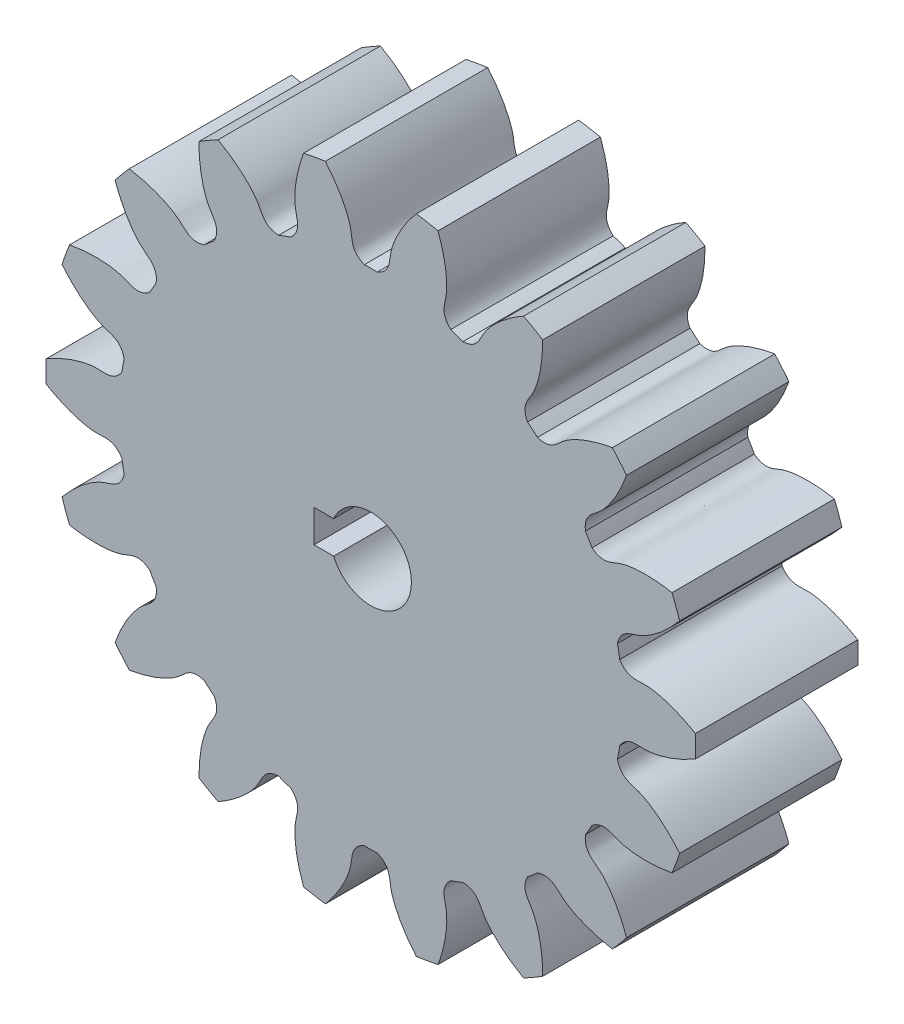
from build123d import *

# Parameters (mm, degrees)
SKETCH_1_R               = 20
EXTRUDE_1_DEPTH          = 10
CUT_EXTRUDE_1_DEPTH      = 31
PATTERN_CIRCULAR_1_COUNT = 18
SKETCH_4_R               = 2.5
CUT_EXTRUDE_2_DEPTH      = 10
SKETCH_8_W               = 2
SKETCH_8_H               = 2
CUT_EXTRUDE_3_DEPTH      = 10


with BuildPart() as part:
    # Sketch 1 → Extrude 1 (new body)
    with BuildSketch(Plane.XY):
        Circle(SKETCH_1_R)
    extrude(amount=EXTRUDE_1_DEPTH)

    # Sketch 2 → Cut-Extrude 1 (cut, through all)
    with BuildSketch(Plane.XY):
        with BuildLine():
            ThreePointArc((0.398807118, 15.494868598), (0, 15.5), (-0.398807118, 15.494868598))
            add(Edge.make_bspline(
                [(-0.398807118, 15.494868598), (-1.23020808, 15.837360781), (-1.1255781, 16.477399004), (-1.263665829, 17.085190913), (-1.27750304, 17.141013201), (-1.294215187, 17.203080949), (-1.314049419, 17.271300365), (-1.337260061, 17.345568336), (-1.364095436, 17.425774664), (-1.394801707, 17.511801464), (-1.429621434, 17.603523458), (-1.46879375, 17.700807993), (-1.512554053, 17.803515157), (-1.561133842, 17.911497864), (-1.614760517, 18.02460196), (-1.673657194, 18.142666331), (-1.738042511, 18.265523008), (-1.80813045, 18.392997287), (-1.884130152, 18.524907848), (-1.96624574, 18.661066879), (-2.054676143, 18.801280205), (-2.149614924, 18.945347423), (-2.25125011, 19.09306204), (-2.359764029, 19.244211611), (-2.475333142, 19.398577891), (-2.598127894, 19.555936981), (-2.728312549, 19.716059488), (-2.866045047, 19.878710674), (-3.011476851, 20.043650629), (-3.164752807, 20.210634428), (-3.326011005, 20.379412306), (-3.495382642, 20.549729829), (-3.672991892, 20.72132807), (-3.858955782, 20.893943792), (-4.053384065, 21.067309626), (-4.256379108, 21.241154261), (-4.468035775, 21.415202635), (-4.68844132, 21.58917612), (-4.917675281, 21.762792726), (-5.155809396, 21.935767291), (-5.402907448, 22.107811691), (-5.748150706, 22.338079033), (-6.015110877, 22.504667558), (-6.197121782, 22.613356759)],
                knots=[0, 0, 0, 0, 0.187591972, 0.192996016, 0.1991206, 0.205965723, 0.213531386, 0.221817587, 0.230824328, 0.240551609, 0.250999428, 0.262167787, 0.274056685, 0.286666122, 0.299996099, 0.314046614, 0.32881767, 0.344309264, 0.360521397, 0.37745407, 0.395107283, 0.413481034, 0.432575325, 0.452390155, 0.472925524, 0.494181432, 0.51615788, 0.538854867, 0.562272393, 0.586410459, 0.611269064, 0.636848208, 0.663147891, 0.690168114, 0.717908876, 0.746370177, 0.775552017, 0.805454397, 0.836077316, 0.867420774, 0.899484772, 0.932269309, 1, 1, 1, 1], degree=3))
            ThreePointArc((-6.197121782, 22.613356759), (0, 23.447136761), (6.197121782, 22.613356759))
            add(Edge.make_bspline(
                [(0.398807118, 15.494868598), (1.23020808, 15.837360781), (1.1255781, 16.477399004), (1.263665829, 17.085190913), (1.27750304, 17.141013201), (1.294215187, 17.203080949), (1.314049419, 17.271300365), (1.337260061, 17.345568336), (1.364095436, 17.425774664), (1.394801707, 17.511801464), (1.429621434, 17.603523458), (1.46879375, 17.700807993), (1.512554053, 17.803515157), (1.561133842, 17.911497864), (1.614760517, 18.02460196), (1.673657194, 18.142666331), (1.738042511, 18.265523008), (1.80813045, 18.392997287), (1.884130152, 18.524907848), (1.96624574, 18.661066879), (2.054676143, 18.801280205), (2.149614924, 18.945347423), (2.25125011, 19.09306204), (2.359764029, 19.244211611), (2.475333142, 19.398577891), (2.598127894, 19.555936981), (2.728312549, 19.716059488), (2.866045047, 19.878710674), (3.011476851, 20.043650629), (3.164752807, 20.210634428), (3.326011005, 20.379412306), (3.495382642, 20.549729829), (3.672991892, 20.72132807), (3.858955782, 20.893943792), (4.053384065, 21.067309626), (4.256379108, 21.241154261), (4.468035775, 21.415202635), (4.68844132, 21.58917612), (4.917675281, 21.762792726), (5.155809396, 21.935767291), (5.402907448, 22.107811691), (5.748150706, 22.338079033), (6.015110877, 22.504667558), (6.197121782, 22.613356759)],
                knots=[0, 0, 0, 0, 0.187591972, 0.192996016, 0.1991206, 0.205965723, 0.213531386, 0.221817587, 0.230824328, 0.240551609, 0.250999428, 0.262167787, 0.274056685, 0.286666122, 0.299996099, 0.314046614, 0.32881767, 0.344309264, 0.360521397, 0.37745407, 0.395107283, 0.413481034, 0.432575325, 0.452390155, 0.472925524, 0.494181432, 0.51615788, 0.538854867, 0.562272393, 0.586410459, 0.611269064, 0.636848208, 0.663147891, 0.690168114, 0.717908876, 0.746370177, 0.775552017, 0.805454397, 0.836077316, 0.867420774, 0.899484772, 0.932269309, 1, 1, 1, 1], degree=3))
        make_face()
    cut_extrude_1 = extrude(amount=CUT_EXTRUDE_1_DEPTH, mode=Mode.SUBTRACT)

    # Pattern Circular 1: Cut-Extrude 1 ×18 about axis
    pattern_circular_1_axis = Axis((0, 0, 10), (0, 0, -1))
    for i in range(1, PATTERN_CIRCULAR_1_COUNT):
        add(cut_extrude_1.rotate(pattern_circular_1_axis, i * 360 / PATTERN_CIRCULAR_1_COUNT), mode=Mode.SUBTRACT)

    # Sketch 4 → Cut-Extrude 2 (cut)
    with BuildSketch(Plane(origin=(0, 0, 0), x_dir=(-1, 0, 0), z_dir=(0, 0, -1))):
        Circle(SKETCH_4_R)
    extrude(amount=-CUT_EXTRUDE_2_DEPTH, mode=Mode.SUBTRACT)

    # Sketch 8 → Cut-Extrude 3 (cut)
    with BuildSketch(Plane(origin=(0, 0, 0), x_dir=(-1, 0, 0), z_dir=(0, 0, -1))):
        with Locations((2.5, 0)):
            Rectangle(SKETCH_8_W, SKETCH_8_H)
    extrude(amount=-CUT_EXTRUDE_3_DEPTH, mode=Mode.SUBTRACT)


solid = part.part
